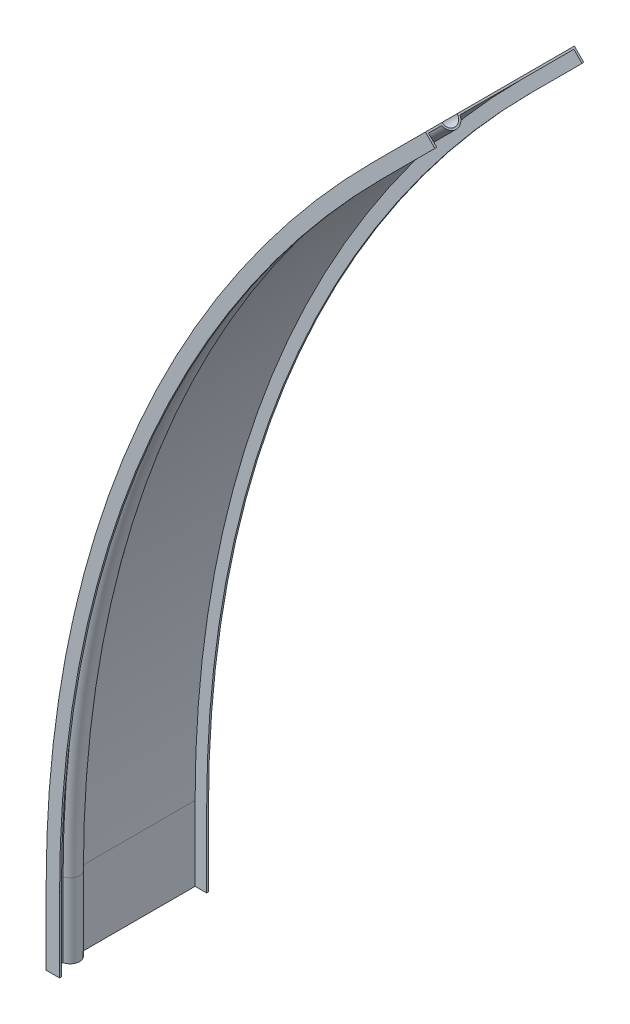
from build123d import *


with BuildPart() as part:
    # Sweep1: sweep along a path in Sketch1
    with BuildLine(Plane.XY) as sweep1_path:
        Line((254.314108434, 613.968569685), (218.958769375, 578.613230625))
        ThreePointArc((218.958769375, 578.613230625), (56.905530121, 336.0834189), (0, 50))
        Line((0, 50), (0, 0))
    # Sketch2 → Sweep1 (sweep)
    with BuildSketch(Plane(origin=(0, 0, 0), x_dir=(1, 0, 0), z_dir=(0, 1, 0))):
        with BuildLine():
            Line((-1.214, 1.214), (7.786, 1.214))
            Line((7.786, 1.214), (7.786, 0))
            Line((7.786, 0), (0, 0))
            Line((0, 0), (0, -76.477740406))
            ThreePointArc((0, -76.477740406), (5, -82.572), (0, -88.666259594))
            Line((0, -88.666259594), (0, -97.572))
            Line((0, -97.572), (7.786, -97.572))
            Line((7.786, -97.572), (7.786, -98.786))
            Line((7.786, -98.786), (-1.214, -98.786))
            Line((-1.214, -98.786), (-1.214, -87.572))
            ThreePointArc((-1.214, -87.572), (3.786, -82.572), (-1.214, -77.572))
            Line((-1.214, -77.572), (-1.214, 1.214))
        make_face()
    sweep(path=sweep1_path.line)


solid = part.part
